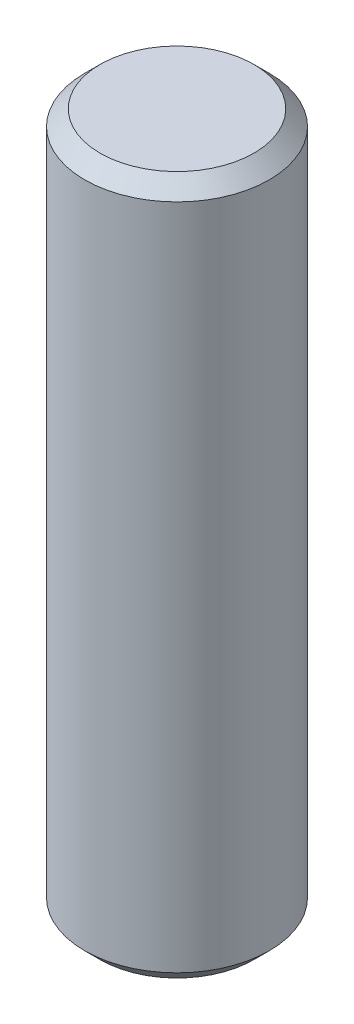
ISO-10303-21;
HEADER;
FILE_DESCRIPTION(('STEP AP214'),'2;1');
FILE_NAME('part.step','',(''),(''),'','','');
FILE_SCHEMA(('AUTOMOTIVE_DESIGN { 1 0 10303 214 1 1 1 1 }'));
ENDSEC;
DATA;
#1=APPLICATION_CONTEXT('core data for automotive mechanical design processes');
#2=APPLICATION_PROTOCOL_DEFINITION('international standard','automotive_design',2000,#1);
#3=PRODUCT_CONTEXT('',#1,'mechanical');
#4=PRODUCT('Part','Part','',(#3));
#5=PRODUCT_RELATED_PRODUCT_CATEGORY('part','',(#4));
#6=PRODUCT_DEFINITION_FORMATION('','',#4);
#7=PRODUCT_DEFINITION_CONTEXT('part definition',#1,'design');
#8=PRODUCT_DEFINITION('design','',#6,#7);
#9=PRODUCT_DEFINITION_SHAPE('','',#8);
#10=(LENGTH_UNIT() NAMED_UNIT(*) SI_UNIT(.MILLI.,.METRE.));
#11=(NAMED_UNIT(*) PLANE_ANGLE_UNIT() SI_UNIT($,.RADIAN.));
#12=(NAMED_UNIT(*) SI_UNIT($,.STERADIAN.) SOLID_ANGLE_UNIT());
#13=UNCERTAINTY_MEASURE_WITH_UNIT(LENGTH_MEASURE(1.E-05),#10,'distance_accuracy_value','');
#14=(GEOMETRIC_REPRESENTATION_CONTEXT(3) GLOBAL_UNCERTAINTY_ASSIGNED_CONTEXT((#13)) GLOBAL_UNIT_ASSIGNED_CONTEXT((#10,
#11,#12)) REPRESENTATION_CONTEXT('',''));
#15=CARTESIAN_POINT('',(0.,0.,0.));
#16=DIRECTION('',(0.,0.,1.));
#17=DIRECTION('',(1.,0.,0.));
#18=AXIS2_PLACEMENT_3D('',#15,#16,#17);
#19=CARTESIAN_POINT('',(0.,22.7,0.));
#20=DIRECTION('',(0.,-1.,0.));
#21=DIRECTION('',(0.,0.,-1.));
#22=AXIS2_PLACEMENT_3D('',#19,#20,#21);
#23=CYLINDRICAL_SURFACE('',#22,3.);
#24=CARTESIAN_POINT('',(0.,0.500000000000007,0.));
#25=DIRECTION('',(0.,1.,0.));
#26=DIRECTION('',(0.,0.,1.));
#27=AXIS2_PLACEMENT_3D('',#24,#25,#26);
#28=CIRCLE('',#27,3.);
#29=CARTESIAN_POINT('',(0.,0.500000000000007,3.));
#30=VERTEX_POINT('',#29);
#31=EDGE_CURVE('E38',#30,#30,#28,.T.);
#32=ORIENTED_EDGE('',*,*,#31,.T.);
#33=EDGE_LOOP('',(#32));
#34=FACE_BOUND('',#33,.T.);
#35=CARTESIAN_POINT('',(0.,22.2,0.));
#36=DIRECTION('',(0.,1.,0.));
#37=DIRECTION('',(0.,0.,1.));
#38=AXIS2_PLACEMENT_3D('',#35,#36,#37);
#39=CIRCLE('',#38,3.);
#40=CARTESIAN_POINT('',(0.,22.2,3.));
#41=VERTEX_POINT('',#40);
#42=EDGE_CURVE('E42',#41,#41,#39,.F.);
#43=ORIENTED_EDGE('',*,*,#42,.T.);
#44=EDGE_LOOP('',(#43));
#45=FACE_BOUND('',#44,.T.);
#46=ADVANCED_FACE('F31',(#34,#45),#23,.T.);
#47=CARTESIAN_POINT('',(0.,22.7,0.));
#48=DIRECTION('',(0.,1.,0.));
#49=DIRECTION('',(0.,0.,1.));
#50=AXIS2_PLACEMENT_3D('',#47,#48,#49);
#51=PLANE('',#50);
#52=CARTESIAN_POINT('',(0.,22.7,0.));
#53=DIRECTION('',(0.,1.,0.));
#54=DIRECTION('',(0.,0.,1.));
#55=AXIS2_PLACEMENT_3D('',#52,#53,#54);
#56=CIRCLE('',#55,2.5);
#57=CARTESIAN_POINT('',(0.,22.7,2.5));
#58=VERTEX_POINT('',#57);
#59=EDGE_CURVE('E46',#58,#58,#56,.T.);
#60=ORIENTED_EDGE('',*,*,#59,.T.);
#61=EDGE_LOOP('',(#60));
#62=FACE_BOUND('',#61,.T.);
#63=ADVANCED_FACE('F52',(#62),#51,.T.);
#64=CARTESIAN_POINT('',(0.,0.,0.));
#65=DIRECTION('',(0.,1.,0.));
#66=DIRECTION('',(0.,0.,1.));
#67=AXIS2_PLACEMENT_3D('',#64,#65,#66);
#68=PLANE('',#67);
#69=CARTESIAN_POINT('',(0.,0.,0.));
#70=DIRECTION('',(0.,1.,0.));
#71=DIRECTION('',(0.,0.,1.));
#72=AXIS2_PLACEMENT_3D('',#69,#70,#71);
#73=CIRCLE('',#72,2.49999999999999);
#74=CARTESIAN_POINT('',(0.,0.,2.49999999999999));
#75=VERTEX_POINT('',#74);
#76=EDGE_CURVE('E10',#75,#75,#73,.F.);
#77=ORIENTED_EDGE('',*,*,#76,.T.);
#78=EDGE_LOOP('',(#77));
#79=FACE_BOUND('',#78,.T.);
#80=ADVANCED_FACE('F56',(#79),#68,.F.);
#81=CARTESIAN_POINT('',(0.,22.7,0.));
#82=DIRECTION('',(0.,-1.,0.));
#83=DIRECTION('',(0.,0.,-1.));
#84=AXIS2_PLACEMENT_3D('',#81,#82,#83);
#85=CONICAL_SURFACE('',#84,2.5,0.78539816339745);
#86=ORIENTED_EDGE('',*,*,#42,.F.);
#87=EDGE_LOOP('',(#86));
#88=FACE_BOUND('',#87,.T.);
#89=ORIENTED_EDGE('',*,*,#59,.F.);
#90=EDGE_LOOP('',(#89));
#91=FACE_BOUND('',#90,.T.);
#92=ADVANCED_FACE('F54',(#88,#91),#85,.T.);
#93=CARTESIAN_POINT('',(0.,0.500000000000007,0.));
#94=DIRECTION('',(0.,1.,0.));
#95=DIRECTION('',(0.,0.,1.));
#96=AXIS2_PLACEMENT_3D('',#93,#94,#95);
#97=CONICAL_SURFACE('',#96,3.,0.785398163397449);
#98=ORIENTED_EDGE('',*,*,#76,.F.);
#99=EDGE_LOOP('',(#98));
#100=FACE_BOUND('',#99,.T.);
#101=ORIENTED_EDGE('',*,*,#31,.F.);
#102=EDGE_LOOP('',(#101));
#103=FACE_BOUND('',#102,.T.);
#104=ADVANCED_FACE('F33',(#100,#103),#97,.T.);
#105=CLOSED_SHELL('',(#46,#63,#80,#92,#104));
#106=MANIFOLD_SOLID_BREP('B2',#105);
#107=ADVANCED_BREP_SHAPE_REPRESENTATION('',(#18,#106),#14);
#108=SHAPE_DEFINITION_REPRESENTATION(#9,#107);
ENDSEC;
END-ISO-10303-21;
